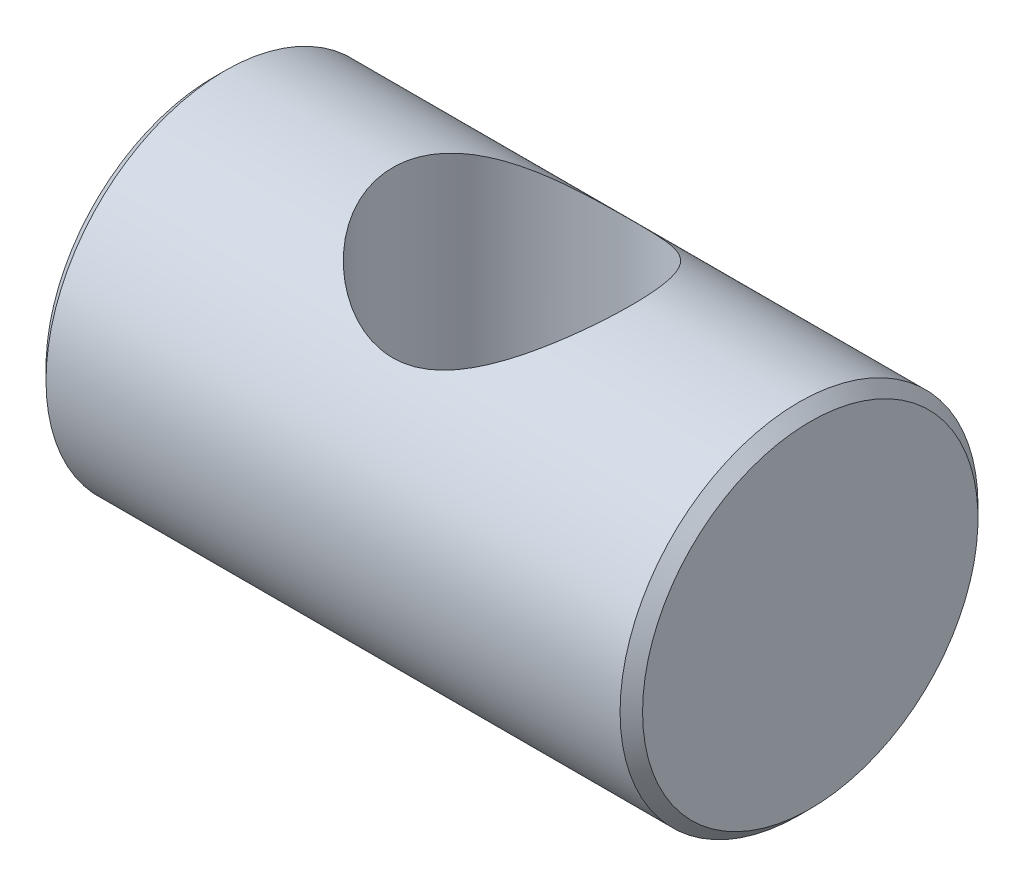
ISO-10303-21;
HEADER;
FILE_DESCRIPTION(('STEP AP214'),'2;1');
FILE_NAME('part.step','',(''),(''),'','','');
FILE_SCHEMA(('AUTOMOTIVE_DESIGN { 1 0 10303 214 1 1 1 1 }'));
ENDSEC;
DATA;
#1=APPLICATION_CONTEXT('core data for automotive mechanical design processes');
#2=APPLICATION_PROTOCOL_DEFINITION('international standard','automotive_design',2000,#1);
#3=PRODUCT_CONTEXT('',#1,'mechanical');
#4=PRODUCT('Part','Part','',(#3));
#5=PRODUCT_RELATED_PRODUCT_CATEGORY('part','',(#4));
#6=PRODUCT_DEFINITION_FORMATION('','',#4);
#7=PRODUCT_DEFINITION_CONTEXT('part definition',#1,'design');
#8=PRODUCT_DEFINITION('design','',#6,#7);
#9=PRODUCT_DEFINITION_SHAPE('','',#8);
#10=(LENGTH_UNIT() NAMED_UNIT(*) SI_UNIT(.MILLI.,.METRE.));
#11=(NAMED_UNIT(*) PLANE_ANGLE_UNIT() SI_UNIT($,.RADIAN.));
#12=(NAMED_UNIT(*) SI_UNIT($,.STERADIAN.) SOLID_ANGLE_UNIT());
#13=UNCERTAINTY_MEASURE_WITH_UNIT(LENGTH_MEASURE(1.E-05),#10,'distance_accuracy_value','');
#14=(GEOMETRIC_REPRESENTATION_CONTEXT(3) GLOBAL_UNCERTAINTY_ASSIGNED_CONTEXT((#13)) GLOBAL_UNIT_ASSIGNED_CONTEXT((#10,
#11,#12)) REPRESENTATION_CONTEXT('',''));
#15=CARTESIAN_POINT('',(0.,0.,0.));
#16=DIRECTION('',(0.,0.,1.));
#17=DIRECTION('',(1.,0.,0.));
#18=AXIS2_PLACEMENT_3D('',#15,#16,#17);
#19=CARTESIAN_POINT('',(7.5,4.21715728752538,0.));
#20=DIRECTION('',(-1.,0.,0.));
#21=DIRECTION('',(0.,0.,1.));
#22=AXIS2_PLACEMENT_3D('',#19,#20,#21);
#23=PLANE('',#22);
#24=CARTESIAN_POINT('',(7.49999999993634,0.,0.));
#25=DIRECTION('',(-1.,0.,0.));
#26=DIRECTION('',(0.,0.,1.));
#27=AXIS2_PLACEMENT_3D('',#24,#25,#26);
#28=CIRCLE('',#27,4.2171572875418);
#29=CARTESIAN_POINT('',(7.49999999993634,0.,4.2171572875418));
#30=VERTEX_POINT('',#29);
#31=EDGE_CURVE('E43',#30,#30,#28,.T.);
#32=ORIENTED_EDGE('',*,*,#31,.F.);
#33=EDGE_LOOP('',(#32));
#34=FACE_BOUND('',#33,.T.);
#35=ADVANCED_FACE('F12',(#34),#23,.F.);
#36=CARTESIAN_POINT('',(-7.5,0.,0.));
#37=DIRECTION('',(1.,0.,0.));
#38=DIRECTION('',(0.,0.,-1.));
#39=AXIS2_PLACEMENT_3D('',#36,#37,#38);
#40=PLANE('',#39);
#41=CARTESIAN_POINT('',(-7.49999999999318,0.,0.));
#42=DIRECTION('',(1.,0.,0.));
#43=DIRECTION('',(0.,0.,-1.));
#44=AXIS2_PLACEMENT_3D('',#41,#42,#43);
#45=CIRCLE('',#44,4.2171572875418);
#46=CARTESIAN_POINT('',(-7.49999999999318,0.,-4.2171572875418));
#47=VERTEX_POINT('',#46);
#48=EDGE_CURVE('E70',#47,#47,#45,.T.);
#49=ORIENTED_EDGE('',*,*,#48,.F.);
#50=EDGE_LOOP('',(#49));
#51=FACE_BOUND('',#50,.T.);
#52=ADVANCED_FACE('F59',(#51),#40,.F.);
#53=CARTESIAN_POINT('',(7.2171572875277,0.,0.));
#54=DIRECTION('',(-1.,0.,0.));
#55=DIRECTION('',(0.,0.,1.));
#56=AXIS2_PLACEMENT_3D('',#53,#54,#55);
#57=CONICAL_SURFACE('',#56,4.49999999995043,0.785398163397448);
#58=CARTESIAN_POINT('',(7.21715728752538,0.,0.));
#59=DIRECTION('',(1.,0.,0.));
#60=DIRECTION('',(0.,0.,-1.));
#61=AXIS2_PLACEMENT_3D('',#58,#59,#60);
#62=CIRCLE('',#61,4.5);
#63=CARTESIAN_POINT('',(7.21715728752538,0.,-4.5));
#64=VERTEX_POINT('',#63);
#65=EDGE_CURVE('E37',#64,#64,#62,.F.);
#66=ORIENTED_EDGE('',*,*,#65,.F.);
#67=EDGE_LOOP('',(#66));
#68=FACE_BOUND('',#67,.T.);
#69=ORIENTED_EDGE('',*,*,#31,.T.);
#70=EDGE_LOOP('',(#69));
#71=FACE_BOUND('',#70,.T.);
#72=ADVANCED_FACE('F64',(#68,#71),#57,.T.);
#73=CARTESIAN_POINT('',(-7.21715728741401,0.,0.));
#74=DIRECTION('',(1.,0.,0.));
#75=DIRECTION('',(0.,0.,-1.));
#76=AXIS2_PLACEMENT_3D('',#73,#74,#75);
#77=CONICAL_SURFACE('',#76,4.50000000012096,0.785398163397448);
#78=ORIENTED_EDGE('',*,*,#48,.T.);
#79=EDGE_LOOP('',(#78));
#80=FACE_BOUND('',#79,.T.);
#81=CARTESIAN_POINT('',(-7.21715728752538,0.,0.));
#82=DIRECTION('',(1.,0.,0.));
#83=DIRECTION('',(0.,0.,-1.));
#84=AXIS2_PLACEMENT_3D('',#81,#82,#83);
#85=CIRCLE('',#84,4.5);
#86=CARTESIAN_POINT('',(-7.21715728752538,0.,-4.5));
#87=VERTEX_POINT('',#86);
#88=EDGE_CURVE('E31',#87,#87,#85,.T.);
#89=ORIENTED_EDGE('',*,*,#88,.F.);
#90=EDGE_LOOP('',(#89));
#91=FACE_BOUND('',#90,.T.);
#92=ADVANCED_FACE('F56',(#80,#91),#77,.T.);
#93=CARTESIAN_POINT('',(7.5,0.,0.));
#94=DIRECTION('',(1.,0.,0.));
#95=DIRECTION('',(0.,0.,-1.));
#96=AXIS2_PLACEMENT_3D('',#93,#94,#95);
#97=CYLINDRICAL_SURFACE('',#96,4.5);
#98=CARTESIAN_POINT('',(3.,-4.5,0.));
#99=CARTESIAN_POINT('',(2.99999813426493,-4.49999851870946,0.15072164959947));
#100=CARTESIAN_POINT('',(2.98857832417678,-4.49236147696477,0.301452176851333));
#101=CARTESIAN_POINT('',(2.94360542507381,-4.46257035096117,0.59810104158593));
#102=CARTESIAN_POINT('',(2.91004182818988,-4.44040937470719,0.744017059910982));
#103=CARTESIAN_POINT('',(2.82283823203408,-4.38375708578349,1.02631807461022));
#104=CARTESIAN_POINT('',(2.76929223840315,-4.34932354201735,1.16274420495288));
#105=CARTESIAN_POINT('',(2.64440500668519,-4.27089210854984,1.42412304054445));
#106=CARTESIAN_POINT('',(2.57306118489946,-4.22689283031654,1.54907407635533));
#107=CARTESIAN_POINT('',(2.40801457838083,-4.12840992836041,1.7959270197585));
#108=CARTESIAN_POINT('',(2.31292820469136,-4.0733534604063,1.9166704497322));
#109=CARTESIAN_POINT('',(2.10640493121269,-3.95973469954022,2.14159207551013));
#110=CARTESIAN_POINT('',(1.99494460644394,-3.9011674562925,2.24574608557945));
#111=CARTESIAN_POINT('',(1.73842144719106,-3.7759239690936,2.45133446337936));
#112=CARTESIAN_POINT('',(1.59083151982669,-3.70942601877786,2.54974779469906));
#113=CARTESIAN_POINT('',(1.2774549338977,-3.58626221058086,2.72025535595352));
#114=CARTESIAN_POINT('',(1.11170039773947,-3.52957943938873,2.79239510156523));
#115=CARTESIAN_POINT('',(0.814933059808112,-3.44964399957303,2.8901105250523));
#116=CARTESIAN_POINT('',(0.687707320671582,-3.42146441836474,2.92311670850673));
#117=CARTESIAN_POINT('',(0.427883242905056,-3.37886954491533,2.97225926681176));
#118=CARTESIAN_POINT('',(0.29529457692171,-3.36443053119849,2.9884247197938));
#119=CARTESIAN_POINT('',(0.0277878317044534,-3.35154908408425,3.002870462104));
#120=CARTESIAN_POINT('',(-0.107137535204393,-3.35317203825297,3.00107764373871));
#121=CARTESIAN_POINT('',(-0.374452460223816,-3.37229663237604,2.97956372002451));
#122=CARTESIAN_POINT('',(-0.506839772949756,-3.3898117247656,2.95982742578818));
#123=CARTESIAN_POINT('',(-0.759700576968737,-3.43690778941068,2.90497491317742));
#124=CARTESIAN_POINT('',(-0.880442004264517,-3.46592232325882,2.87057567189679));
#125=CARTESIAN_POINT('',(-1.11453553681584,-3.53264434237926,2.78805177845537));
#126=CARTESIAN_POINT('',(-1.22788519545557,-3.57035468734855,2.73992260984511));
#127=CARTESIAN_POINT('',(-1.46853809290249,-3.65946294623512,2.62010728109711));
#128=CARTESIAN_POINT('',(-1.59398985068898,-3.71208476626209,2.54562078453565));
#129=CARTESIAN_POINT('',(-1.83207509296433,-3.82037306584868,2.3800344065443));
#130=CARTESIAN_POINT('',(-1.94469248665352,-3.8760432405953,2.28891403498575));
#131=CARTESIAN_POINT('',(-2.17881381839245,-3.9981501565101,2.06971747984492));
#132=CARTESIAN_POINT('',(-2.29700107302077,-4.06432117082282,1.93790907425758));
#133=CARTESIAN_POINT('',(-2.50979474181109,-4.18827150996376,1.65301199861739));
#134=CARTESIAN_POINT('',(-2.60442321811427,-4.24605866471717,1.49994344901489));
#135=CARTESIAN_POINT('',(-2.75021657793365,-4.33718106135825,1.20728674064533));
#136=CARTESIAN_POINT('',(-2.80626504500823,-4.37308891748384,1.07093646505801));
#137=CARTESIAN_POINT('',(-2.89815738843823,-4.43261578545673,0.789054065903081));
#138=CARTESIAN_POINT('',(-2.93401834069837,-4.45624518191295,0.643529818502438));
#139=CARTESIAN_POINT('',(-2.98374174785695,-4.48913823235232,0.346478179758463));
#140=CARTESIAN_POINT('',(-2.99750919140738,-4.49833983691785,0.194927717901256));
#141=CARTESIAN_POINT('',(-3.00187063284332,-4.50124672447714,-0.108662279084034));
#142=CARTESIAN_POINT('',(-2.99246625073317,-4.4949530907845,-0.260701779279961));
#143=CARTESIAN_POINT('',(-2.95256391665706,-4.46849384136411,-0.549683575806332));
#144=CARTESIAN_POINT('',(-2.92359405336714,-4.44933369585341,-0.686936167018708));
#145=CARTESIAN_POINT('',(-2.84760647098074,-4.39977673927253,-0.954174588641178));
#146=CARTESIAN_POINT('',(-2.80058587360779,-4.36937813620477,-1.08415925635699));
#147=CARTESIAN_POINT('',(-2.6870215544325,-4.29744528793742,-1.34199712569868));
#148=CARTESIAN_POINT('',(-2.61946776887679,-4.255348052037,-1.46924427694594));
#149=CARTESIAN_POINT('',(-2.46835006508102,-4.16402783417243,-1.71102453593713));
#150=CARTESIAN_POINT('',(-2.38477625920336,-4.11480045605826,-1.82554972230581));
#151=CARTESIAN_POINT('',(-2.18908819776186,-4.00431819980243,-2.0577816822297));
#152=CARTESIAN_POINT('',(-2.07455060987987,-3.9423923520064,-2.17312781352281));
#153=CARTESIAN_POINT('',(-1.82833285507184,-3.81856759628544,-2.3840095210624));
#154=CARTESIAN_POINT('',(-1.69664094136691,-3.75666873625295,-2.47953140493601));
#155=CARTESIAN_POINT('',(-1.42928638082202,-3.64409518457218,-2.6418716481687));
#156=CARTESIAN_POINT('',(-1.29490194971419,-3.59291395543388,-2.71043454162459));
#157=CARTESIAN_POINT('',(-1.01419102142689,-3.50158461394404,-2.82744320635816));
#158=CARTESIAN_POINT('',(-0.867886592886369,-3.46141668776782,-2.87592518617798));
#159=CARTESIAN_POINT('',(-0.593153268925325,-3.40399812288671,-2.94353765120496));
#160=CARTESIAN_POINT('',(-0.466242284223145,-3.38392497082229,-2.96637896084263));
#161=CARTESIAN_POINT('',(-0.209140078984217,-3.35819199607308,-2.99548809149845));
#162=CARTESIAN_POINT('',(-0.0789525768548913,-3.35251651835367,-3.00177391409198));
#163=CARTESIAN_POINT('',(0.180964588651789,-3.3564630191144,-2.99735881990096));
#164=CARTESIAN_POINT('',(0.3106939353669,-3.36609405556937,-2.98664784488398));
#165=CARTESIAN_POINT('',(0.566015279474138,-3.39915677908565,-2.94895499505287));
#166=CARTESIAN_POINT('',(0.69160152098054,-3.42260687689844,-2.9219514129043));
#167=CARTESIAN_POINT('',(0.968566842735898,-3.48790269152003,-2.84389536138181));
#168=CARTESIAN_POINT('',(1.11790183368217,-3.53298514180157,-2.78835207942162));
#169=CARTESIAN_POINT('',(1.4032299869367,-3.63333227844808,-2.65626862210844));
#170=CARTESIAN_POINT('',(1.53920405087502,-3.68861122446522,-2.57969896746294));
#171=CARTESIAN_POINT('',(1.79892384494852,-3.80425832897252,-2.40597141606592));
#172=CARTESIAN_POINT('',(1.92240193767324,-3.86470080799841,-2.3084641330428));
#173=CARTESIAN_POINT('',(2.15297989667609,-3.98442252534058,-2.09508703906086));
#174=CARTESIAN_POINT('',(2.26007472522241,-4.04370140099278,-1.97921160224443));
#175=CARTESIAN_POINT('',(2.47008447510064,-4.16448181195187,-1.71214106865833));
#176=CARTESIAN_POINT('',(2.5701929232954,-4.22508104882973,-1.55826365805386));
#177=CARTESIAN_POINT('',(2.69899932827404,-4.30505398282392,-1.31299166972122));
#178=CARTESIAN_POINT('',(2.73837392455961,-4.32988963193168,-1.22882978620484));
#179=CARTESIAN_POINT('',(2.80946645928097,-4.37519698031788,-1.05622318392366));
#180=CARTESIAN_POINT('',(2.8411870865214,-4.39567021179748,-0.967779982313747));
#181=CARTESIAN_POINT('',(2.91169488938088,-4.44149572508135,-0.737227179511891));
#182=CARTESIAN_POINT('',(2.94465665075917,-4.4632644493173,-0.592538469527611));
#183=CARTESIAN_POINT('',(2.98880194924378,-4.49251195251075,-0.298567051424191));
#184=CARTESIAN_POINT('',(3.00000184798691,-4.50000146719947,-0.149287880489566));
#185=CARTESIAN_POINT('',(3.,-4.5,0.));
#186=B_SPLINE_CURVE_WITH_KNOTS('',3,(#98,#99,#100,#101,#102,#103,#104,#105,#106,#107,#108,#109,
#110,#111,#112,#113,#114,#115,#116,#117,#118,#119,#120,#121,#122,#123,#124,#125,#126,#127,#128,
#129,#130,#131,#132,#133,#134,#135,#136,#137,#138,#139,#140,#141,#142,#143,#144,#145,#146,#147,
#148,#149,#150,#151,#152,#153,#154,#155,#156,#157,#158,#159,#160,#161,#162,#163,#164,#165,#166,
#167,#168,#169,#170,#171,#172,#173,#174,#175,#176,#177,#178,#179,#180,#181,#182,#183,#184,#185),
.UNSPECIFIED.,.T.,.F.,(4,2,2,2,2,2,2,2,2,2,2,2,2,2,2,2,2,2,2,2,2,2,2,2,2,2,2,2,2,2,2,2,2,2,2,2,
2,2,2,2,2,2,2,4),(0.,0.451579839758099,0.903374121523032,1.35306922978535,1.80282965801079,
2.29075543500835,2.77938617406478,3.34510024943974,3.90982958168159,4.31150540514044,
4.71248651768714,5.11510067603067,5.51805595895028,5.90323293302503,6.28853675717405,
6.75221362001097,7.21646555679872,7.78078431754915,8.3445726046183,8.79786131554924,
9.25076602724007,9.70561324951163,10.1604286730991,10.583296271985,11.0062313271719,
11.4547852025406,11.9036168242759,12.4234226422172,12.9435862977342,13.419749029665,
13.8950493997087,14.2848607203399,14.6742480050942,15.0638658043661,15.4540038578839,
15.9480991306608,16.4428907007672,16.9466886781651,17.4506412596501,18.0269302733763,
18.3150447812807,18.603057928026,19.0506787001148,19.4979627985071),.UNSPECIFIED.);
#187=CARTESIAN_POINT('',(3.,-4.5,0.));
#188=VERTEX_POINT('',#187);
#189=EDGE_CURVE('E8',#188,#188,#186,.T.);
#190=ORIENTED_EDGE('',*,*,#189,.F.);
#191=EDGE_LOOP('',(#190));
#192=FACE_BOUND('',#191,.T.);
#193=CARTESIAN_POINT('',(0.,3.35410196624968,3.));
#194=CARTESIAN_POINT('',(0.0732569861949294,3.35409414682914,3.00000458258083));
#195=CARTESIAN_POINT('',(0.146481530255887,3.35651144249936,2.99731244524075));
#196=CARTESIAN_POINT('',(0.292242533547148,3.36602370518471,2.98662615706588));
#197=CARTESIAN_POINT('',(0.364778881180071,3.37311941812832,2.97863116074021));
#198=CARTESIAN_POINT('',(0.580557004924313,3.40099728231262,2.94687150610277));
#199=CARTESIAN_POINT('',(0.721887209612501,3.42836960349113,2.91533243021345));
#200=CARTESIAN_POINT('',(0.994135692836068,3.49584414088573,2.83403844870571));
#201=CARTESIAN_POINT('',(1.12514051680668,3.53582228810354,2.78446038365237));
#202=CARTESIAN_POINT('',(1.37678977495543,3.62376255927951,2.66901051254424));
#203=CARTESIAN_POINT('',(1.49743205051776,3.67172634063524,2.60313532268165));
#204=CARTESIAN_POINT('',(1.7454742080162,3.77919120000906,2.44503375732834));
#205=CARTESIAN_POINT('',(1.87100290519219,3.83932601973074,2.35030173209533));
#206=CARTESIAN_POINT('',(2.10599933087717,3.95917042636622,2.14229810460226));
#207=CARTESIAN_POINT('',(2.21545122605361,4.01887953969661,2.02900845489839));
#208=CARTESIAN_POINT('',(2.43098271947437,4.14134123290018,1.76719317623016));
#209=CARTESIAN_POINT('',(2.53429147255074,4.20328759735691,1.61594159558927));
#210=CARTESIAN_POINT('',(2.6683430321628,4.28588873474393,1.37421346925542));
#211=CARTESIAN_POINT('',(2.70954965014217,4.31170810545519,1.29113866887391));
#212=CARTESIAN_POINT('',(2.78442936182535,4.35915144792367,1.12054013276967));
#213=CARTESIAN_POINT('',(2.818108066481,4.38077854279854,1.03301977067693));
#214=CARTESIAN_POINT('',(2.87404180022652,4.41698044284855,0.864225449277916));
#215=CARTESIAN_POINT('',(2.89715242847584,4.43207302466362,0.78334499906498));
#216=CARTESIAN_POINT('',(2.93658943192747,4.45795195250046,0.619315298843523));
#217=CARTESIAN_POINT('',(2.95291997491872,4.46874094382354,0.536167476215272));
#218=CARTESIAN_POINT('',(2.97850414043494,4.48568768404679,0.368381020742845));
#219=CARTESIAN_POINT('',(2.98776324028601,4.49184901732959,0.28374359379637));
#220=CARTESIAN_POINT('',(2.99905173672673,4.49936633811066,0.11380694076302));
#221=CARTESIAN_POINT('',(3.00108215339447,4.50072300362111,0.028507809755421));
#222=CARTESIAN_POINT('',(2.99672182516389,4.49781194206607,-0.201115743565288));
#223=CARTESIAN_POINT('',(2.98351119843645,4.48898902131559,-0.345332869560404));
#224=CARTESIAN_POINT('',(2.93686864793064,4.45812769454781,-0.628886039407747));
#225=CARTESIAN_POINT('',(2.90343524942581,4.4360883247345,-0.768221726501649));
#226=CARTESIAN_POINT('',(2.81820508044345,4.38078005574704,-1.03810942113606));
#227=CARTESIAN_POINT('',(2.76648129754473,4.34755581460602,-1.16869392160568));
#228=CARTESIAN_POINT('',(2.64666991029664,4.27231692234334,-1.41931574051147));
#229=CARTESIAN_POINT('',(2.57857931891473,4.2303006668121,-1.53935112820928));
#230=CARTESIAN_POINT('',(2.41803177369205,4.13427076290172,-1.78242579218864));
#231=CARTESIAN_POINT('',(2.32354868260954,4.07940610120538,-1.90378704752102));
#232=CARTESIAN_POINT('',(2.11815201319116,3.9660090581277,-2.12998228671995));
#233=CARTESIAN_POINT('',(2.00721309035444,3.90747110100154,-2.23479025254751));
#234=CARTESIAN_POINT('',(1.75205517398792,3.78225066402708,-2.44158347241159));
#235=CARTESIAN_POINT('',(1.60534337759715,3.71571479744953,-2.54060388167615));
#236=CARTESIAN_POINT('',(1.29373524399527,3.59213416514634,-2.71252313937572));
#237=CARTESIAN_POINT('',(1.12887000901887,3.53507357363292,-2.78546578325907));
#238=CARTESIAN_POINT('',(0.83292140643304,3.45394305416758,-2.88499086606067));
#239=CARTESIAN_POINT('',(0.705609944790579,3.42510546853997,-2.91886187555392));
#240=CARTESIAN_POINT('',(0.445440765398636,3.381135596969,-2.96969333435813));
#241=CARTESIAN_POINT('',(0.312593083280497,3.36597955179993,-2.98668310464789));
#242=CARTESIAN_POINT('',(0.0443355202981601,3.35171335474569,-3.0026910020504));
#243=CARTESIAN_POINT('',(-0.0910829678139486,3.35267300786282,-3.0016309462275));
#244=CARTESIAN_POINT('',(-0.359525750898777,3.37064820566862,-2.98142444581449));
#245=CARTESIAN_POINT('',(-0.492548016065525,3.38767676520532,-2.96226334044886));
#246=CARTESIAN_POINT('',(-0.746084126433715,3.43391966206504,-2.90849716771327));
#247=CARTESIAN_POINT('',(-0.866891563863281,3.46249780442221,-2.87469261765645));
#248=CARTESIAN_POINT('',(-1.10118935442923,3.52844937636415,-2.79334562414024));
#249=CARTESIAN_POINT('',(-1.21467723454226,3.56582575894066,-2.74579856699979));
#250=CARTESIAN_POINT('',(-1.45530300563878,3.65417225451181,-2.6274501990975));
#251=CARTESIAN_POINT('',(-1.5806352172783,3.70636622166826,-2.55390043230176));
#252=CARTESIAN_POINT('',(-1.81862520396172,3.8139377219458,-2.39029097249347));
#253=CARTESIAN_POINT('',(-1.93126727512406,3.86931907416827,-2.30021117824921));
#254=CARTESIAN_POINT('',(-2.16594352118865,3.99113517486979,-2.08314986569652));
#255=CARTESIAN_POINT('',(-2.28465427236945,4.05734178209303,-1.95240579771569));
#256=CARTESIAN_POINT('',(-2.49872502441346,4.18163372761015,-1.6696492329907));
#257=CARTESIAN_POINT('',(-2.59410565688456,4.23972622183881,-1.51765571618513));
#258=CARTESIAN_POINT('',(-2.74183760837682,4.33186231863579,-1.226231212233));
#259=CARTESIAN_POINT('',(-2.79893475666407,4.36838187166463,-1.08999354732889));
#260=CARTESIAN_POINT('',(-2.89291079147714,4.4291806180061,-0.808135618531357));
#261=CARTESIAN_POINT('',(-2.929806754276,4.45347014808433,-0.6625233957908));
#262=CARTESIAN_POINT('',(-2.98154544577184,4.48767546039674,-0.365054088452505));
#263=CARTESIAN_POINT('',(-2.99629001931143,4.49752726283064,-0.213172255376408));
#264=CARTESIAN_POINT('',(-3.00247177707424,4.50164731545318,0.0912833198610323));
#265=CARTESIAN_POINT('',(-2.99391112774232,4.49591701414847,0.243856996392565));
#266=CARTESIAN_POINT('',(-2.95551076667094,4.47044333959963,0.533636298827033));
#267=CARTESIAN_POINT('',(-2.92726352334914,4.45174915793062,0.671152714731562));
#268=CARTESIAN_POINT('',(-2.8526429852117,4.40304159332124,0.939027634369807));
#269=CARTESIAN_POINT('',(-2.80626687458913,4.37302645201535,1.06938502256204));
#270=CARTESIAN_POINT('',(-2.69409194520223,4.3018764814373,1.32772094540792));
#271=CARTESIAN_POINT('',(-2.62732454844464,4.26019873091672,1.45512538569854));
#272=CARTESIAN_POINT('',(-2.47777402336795,4.16963112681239,1.69732899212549));
#273=CARTESIAN_POINT('',(-2.39498131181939,4.1207369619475,1.81212055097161));
#274=CARTESIAN_POINT('',(-2.20105668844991,4.01089395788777,2.04494134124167));
#275=CARTESIAN_POINT('',(-2.08751563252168,3.94925865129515,2.16064022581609));
#276=CARTESIAN_POINT('',(-1.84332951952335,3.82580042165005,2.37240030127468));
#277=CARTESIAN_POINT('',(-1.7126717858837,3.76397739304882,2.46844680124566));
#278=CARTESIAN_POINT('',(-1.44619919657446,3.65076300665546,2.63269891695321));
#279=CARTESIAN_POINT('',(-1.31153938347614,3.59893559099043,2.70247011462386));
#280=CARTESIAN_POINT('',(-1.0300712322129,3.50621323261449,2.82173662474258));
#281=CARTESIAN_POINT('',(-0.883287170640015,3.46529710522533,2.87127132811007));
#282=CARTESIAN_POINT('',(-0.613848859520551,3.40786372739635,2.93904512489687));
#283=CARTESIAN_POINT('',(-0.49305793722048,3.38794856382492,2.96178740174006));
#284=CARTESIAN_POINT('',(-0.248145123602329,3.36107964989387,2.99225476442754));
#285=CARTESIAN_POINT('',(-0.12402606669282,3.35411520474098,2.99999224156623));
#286=CARTESIAN_POINT('',(0.,3.35410196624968,3.));
#287=B_SPLINE_CURVE_WITH_KNOTS('',3,(#193,#194,#195,#196,#197,#198,#199,#200,#201,#202,#203,
#204,#205,#206,#207,#208,#209,#210,#211,#212,#213,#214,#215,#216,#217,#218,#219,#220,#221,#222,
#223,#224,#225,#226,#227,#228,#229,#230,#231,#232,#233,#234,#235,#236,#237,#238,#239,#240,#241,
#242,#243,#244,#245,#246,#247,#248,#249,#250,#251,#252,#253,#254,#255,#256,#257,#258,#259,#260,
#261,#262,#263,#264,#265,#266,#267,#268,#269,#270,#271,#272,#273,#274,#275,#276,#277,#278,#279,
#280,#281,#282,#283,#284,#285,#286),.UNSPECIFIED.,.T.,.F.,(4,2,2,2,2,2,2,2,2,2,2,2,2,2,2,2,2,2,
2,2,2,2,2,2,2,2,2,2,2,2,2,2,2,2,2,2,2,2,2,2,2,2,2,2,2,2,4),(0.,0.219620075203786,
0.439275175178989,0.878823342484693,1.31417375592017,1.749614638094,2.25283493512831,
2.75654755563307,3.33302024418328,3.62140722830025,3.90957854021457,4.16557735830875,
4.42141857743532,4.67706142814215,4.93266820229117,5.36561317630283,5.79858972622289,
6.22985763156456,6.6612043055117,7.14923304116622,7.63802137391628,8.20270070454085,
8.76642719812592,9.16941150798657,9.571694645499,9.97572071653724,10.3800743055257,
10.764666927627,11.1493888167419,11.6110086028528,12.0731935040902,12.636340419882,
13.1989875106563,13.653578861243,14.1077853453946,14.56399859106,15.0201694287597,
15.4431718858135,15.8662400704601,16.3137880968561,16.7616045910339,17.2798532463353,
17.7984879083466,18.2775320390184,18.755639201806,19.1277693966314,19.4995921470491),.UNSPECIFIED.);
#288=CARTESIAN_POINT('',(0.,3.35410196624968,3.));
#289=VERTEX_POINT('',#288);
#290=EDGE_CURVE('E24',#289,#289,#287,.T.);
#291=ORIENTED_EDGE('',*,*,#290,.F.);
#292=EDGE_LOOP('',(#291));
#293=FACE_BOUND('',#292,.T.);
#294=ORIENTED_EDGE('',*,*,#88,.T.);
#295=EDGE_LOOP('',(#294));
#296=FACE_BOUND('',#295,.T.);
#297=ORIENTED_EDGE('',*,*,#65,.T.);
#298=EDGE_LOOP('',(#297));
#299=FACE_BOUND('',#298,.T.);
#300=ADVANCED_FACE('F45',(#192,#293,#296,#299),#97,.T.);
#301=CARTESIAN_POINT('',(0.,-4.5,0.));
#302=DIRECTION('',(0.,1.,0.));
#303=DIRECTION('',(0.,0.,1.));
#304=AXIS2_PLACEMENT_3D('',#301,#302,#303);
#305=CYLINDRICAL_SURFACE('',#304,3.);
#306=ORIENTED_EDGE('',*,*,#189,.T.);
#307=EDGE_LOOP('',(#306));
#308=FACE_BOUND('',#307,.T.);
#309=ORIENTED_EDGE('',*,*,#290,.T.);
#310=EDGE_LOOP('',(#309));
#311=FACE_BOUND('',#310,.T.);
#312=ADVANCED_FACE('F48',(#308,#311),#305,.F.);
#313=CLOSED_SHELL('',(#35,#52,#72,#92,#300,#312));
#314=MANIFOLD_SOLID_BREP('B1',#313);
#315=ADVANCED_BREP_SHAPE_REPRESENTATION('',(#18,#314),#14);
#316=SHAPE_DEFINITION_REPRESENTATION(#9,#315);
ENDSEC;
END-ISO-10303-21;
